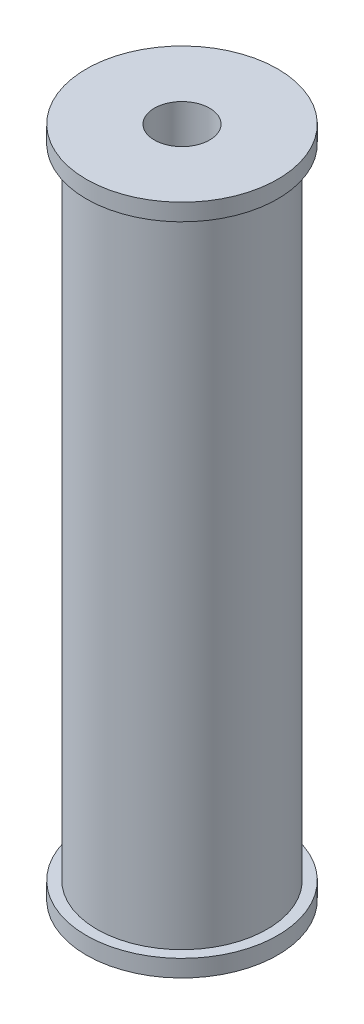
ISO-10303-21;
HEADER;
FILE_DESCRIPTION(('STEP AP214'),'2;1');
FILE_NAME('part.step','',(''),(''),'','','');
FILE_SCHEMA(('AUTOMOTIVE_DESIGN { 1 0 10303 214 1 1 1 1 }'));
ENDSEC;
DATA;
#1=APPLICATION_CONTEXT('core data for automotive mechanical design processes');
#2=APPLICATION_PROTOCOL_DEFINITION('international standard','automotive_design',2000,#1);
#3=PRODUCT_CONTEXT('',#1,'mechanical');
#4=PRODUCT('Part','Part','',(#3));
#5=PRODUCT_RELATED_PRODUCT_CATEGORY('part','',(#4));
#6=PRODUCT_DEFINITION_FORMATION('','',#4);
#7=PRODUCT_DEFINITION_CONTEXT('part definition',#1,'design');
#8=PRODUCT_DEFINITION('design','',#6,#7);
#9=PRODUCT_DEFINITION_SHAPE('','',#8);
#10=(LENGTH_UNIT() NAMED_UNIT(*) SI_UNIT(.MILLI.,.METRE.));
#11=(NAMED_UNIT(*) PLANE_ANGLE_UNIT() SI_UNIT($,.RADIAN.));
#12=(NAMED_UNIT(*) SI_UNIT($,.STERADIAN.) SOLID_ANGLE_UNIT());
#13=UNCERTAINTY_MEASURE_WITH_UNIT(LENGTH_MEASURE(1.E-05),#10,'distance_accuracy_value','');
#14=(GEOMETRIC_REPRESENTATION_CONTEXT(3) GLOBAL_UNCERTAINTY_ASSIGNED_CONTEXT((#13)) GLOBAL_UNIT_ASSIGNED_CONTEXT((#10,
#11,#12)) REPRESENTATION_CONTEXT('',''));
#15=CARTESIAN_POINT('',(0.,0.,0.));
#16=DIRECTION('',(0.,0.,1.));
#17=DIRECTION('',(1.,0.,0.));
#18=AXIS2_PLACEMENT_3D('',#15,#16,#17);
#19=CARTESIAN_POINT('',(0.,2.54,0.));
#20=DIRECTION('',(0.,1.,0.));
#21=DIRECTION('',(0.,0.,1.));
#22=AXIS2_PLACEMENT_3D('',#19,#20,#21);
#23=PLANE('',#22);
#24=CARTESIAN_POINT('',(0.,2.54,0.));
#25=DIRECTION('',(0.,1.,0.));
#26=DIRECTION('',(0.,0.,1.));
#27=AXIS2_PLACEMENT_3D('',#24,#25,#26);
#28=CIRCLE('',#27,14.2875);
#29=CARTESIAN_POINT('',(0.,2.54,14.2875));
#30=VERTEX_POINT('',#29);
#31=EDGE_CURVE('E10',#30,#30,#28,.T.);
#32=ORIENTED_EDGE('',*,*,#31,.T.);
#33=EDGE_LOOP('',(#32));
#34=FACE_BOUND('',#33,.T.);
#35=CARTESIAN_POINT('',(0.,2.54,0.));
#36=DIRECTION('',(0.,1.,0.));
#37=DIRECTION('',(0.,0.,1.));
#38=AXIS2_PLACEMENT_3D('',#35,#36,#37);
#39=CIRCLE('',#38,12.7);
#40=CARTESIAN_POINT('',(0.,2.54,12.7));
#41=VERTEX_POINT('',#40);
#42=EDGE_CURVE('E43',#41,#41,#39,.T.);
#43=ORIENTED_EDGE('',*,*,#42,.F.);
#44=EDGE_LOOP('',(#43));
#45=FACE_BOUND('',#44,.T.);
#46=ADVANCED_FACE('F28',(#34,#45),#23,.T.);
#47=CARTESIAN_POINT('',(0.,2.54,0.));
#48=DIRECTION('',(0.,-1.,0.));
#49=DIRECTION('',(0.,0.,-1.));
#50=AXIS2_PLACEMENT_3D('',#47,#48,#49);
#51=CYLINDRICAL_SURFACE('',#50,14.2875);
#52=ORIENTED_EDGE('',*,*,#31,.F.);
#53=EDGE_LOOP('',(#52));
#54=FACE_BOUND('',#53,.T.);
#55=CARTESIAN_POINT('',(0.,0.,0.));
#56=DIRECTION('',(0.,1.,0.));
#57=DIRECTION('',(0.,0.,1.));
#58=AXIS2_PLACEMENT_3D('',#55,#56,#57);
#59=CIRCLE('',#58,14.2875);
#60=CARTESIAN_POINT('',(0.,0.,14.2875));
#61=VERTEX_POINT('',#60);
#62=EDGE_CURVE('E35',#61,#61,#59,.T.);
#63=ORIENTED_EDGE('',*,*,#62,.T.);
#64=EDGE_LOOP('',(#63));
#65=FACE_BOUND('',#64,.T.);
#66=ADVANCED_FACE('F30',(#54,#65),#51,.T.);
#67=CARTESIAN_POINT('',(0.,0.,0.));
#68=DIRECTION('',(0.,1.,0.));
#69=DIRECTION('',(0.,0.,1.));
#70=AXIS2_PLACEMENT_3D('',#67,#68,#69);
#71=PLANE('',#70);
#72=CARTESIAN_POINT('',(0.,0.,0.));
#73=DIRECTION('',(0.,1.,0.));
#74=DIRECTION('',(0.,0.,1.));
#75=AXIS2_PLACEMENT_3D('',#72,#73,#74);
#76=CIRCLE('',#75,4.1275);
#77=CARTESIAN_POINT('',(0.,0.,4.1275));
#78=VERTEX_POINT('',#77);
#79=EDGE_CURVE('E54',#78,#78,#76,.T.);
#80=ORIENTED_EDGE('',*,*,#79,.T.);
#81=EDGE_LOOP('',(#80));
#82=FACE_BOUND('',#81,.T.);
#83=ORIENTED_EDGE('',*,*,#62,.F.);
#84=EDGE_LOOP('',(#83));
#85=FACE_BOUND('',#84,.T.);
#86=ADVANCED_FACE('F84',(#82,#85),#71,.F.);
#87=CARTESIAN_POINT('',(0.,97.79,0.));
#88=DIRECTION('',(0.,-1.,0.));
#89=DIRECTION('',(0.,0.,-1.));
#90=AXIS2_PLACEMENT_3D('',#87,#88,#89);
#91=CYLINDRICAL_SURFACE('',#90,12.7);
#92=CARTESIAN_POINT('',(0.,97.79,0.));
#93=DIRECTION('',(0.,1.,0.));
#94=DIRECTION('',(0.,0.,1.));
#95=AXIS2_PLACEMENT_3D('',#92,#93,#94);
#96=CIRCLE('',#95,12.7);
#97=CARTESIAN_POINT('',(0.,97.79,12.7));
#98=VERTEX_POINT('',#97);
#99=EDGE_CURVE('E39',#98,#98,#96,.T.);
#100=ORIENTED_EDGE('',*,*,#99,.F.);
#101=EDGE_LOOP('',(#100));
#102=FACE_BOUND('',#101,.T.);
#103=ORIENTED_EDGE('',*,*,#42,.T.);
#104=EDGE_LOOP('',(#103));
#105=FACE_BOUND('',#104,.T.);
#106=ADVANCED_FACE('F78',(#102,#105),#91,.T.);
#107=CARTESIAN_POINT('',(0.,97.79,0.));
#108=DIRECTION('',(0.,1.,0.));
#109=DIRECTION('',(0.,0.,1.));
#110=AXIS2_PLACEMENT_3D('',#107,#108,#109);
#111=PLANE('',#110);
#112=CARTESIAN_POINT('',(0.,97.79,0.));
#113=DIRECTION('',(0.,1.,0.));
#114=DIRECTION('',(0.,0.,1.));
#115=AXIS2_PLACEMENT_3D('',#112,#113,#114);
#116=CIRCLE('',#115,14.2875);
#117=CARTESIAN_POINT('',(0.,97.79,14.2875));
#118=VERTEX_POINT('',#117);
#119=EDGE_CURVE('E51',#118,#118,#116,.T.);
#120=ORIENTED_EDGE('',*,*,#119,.F.);
#121=EDGE_LOOP('',(#120));
#122=FACE_BOUND('',#121,.T.);
#123=ORIENTED_EDGE('',*,*,#99,.T.);
#124=EDGE_LOOP('',(#123));
#125=FACE_BOUND('',#124,.T.);
#126=ADVANCED_FACE('F72',(#122,#125),#111,.F.);
#127=CARTESIAN_POINT('',(0.,100.33,0.));
#128=DIRECTION('',(0.,-1.,0.));
#129=DIRECTION('',(0.,0.,-1.));
#130=AXIS2_PLACEMENT_3D('',#127,#128,#129);
#131=CYLINDRICAL_SURFACE('',#130,14.2875);
#132=CARTESIAN_POINT('',(0.,100.33,0.));
#133=DIRECTION('',(0.,1.,0.));
#134=DIRECTION('',(0.,0.,1.));
#135=AXIS2_PLACEMENT_3D('',#132,#133,#134);
#136=CIRCLE('',#135,14.2875);
#137=CARTESIAN_POINT('',(0.,100.33,14.2875));
#138=VERTEX_POINT('',#137);
#139=EDGE_CURVE('E48',#138,#138,#136,.T.);
#140=ORIENTED_EDGE('',*,*,#139,.F.);
#141=EDGE_LOOP('',(#140));
#142=FACE_BOUND('',#141,.T.);
#143=ORIENTED_EDGE('',*,*,#119,.T.);
#144=EDGE_LOOP('',(#143));
#145=FACE_BOUND('',#144,.T.);
#146=ADVANCED_FACE('F66',(#142,#145),#131,.T.);
#147=CARTESIAN_POINT('',(0.,100.33,0.));
#148=DIRECTION('',(0.,1.,0.));
#149=DIRECTION('',(0.,0.,1.));
#150=AXIS2_PLACEMENT_3D('',#147,#148,#149);
#151=PLANE('',#150);
#152=CARTESIAN_POINT('',(0.,100.33,0.));
#153=DIRECTION('',(0.,1.,0.));
#154=DIRECTION('',(0.,0.,1.));
#155=AXIS2_PLACEMENT_3D('',#152,#153,#154);
#156=CIRCLE('',#155,4.1275);
#157=CARTESIAN_POINT('',(0.,100.33,4.1275));
#158=VERTEX_POINT('',#157);
#159=EDGE_CURVE('E57',#158,#158,#156,.T.);
#160=ORIENTED_EDGE('',*,*,#159,.F.);
#161=EDGE_LOOP('',(#160));
#162=FACE_BOUND('',#161,.T.);
#163=ORIENTED_EDGE('',*,*,#139,.T.);
#164=EDGE_LOOP('',(#163));
#165=FACE_BOUND('',#164,.T.);
#166=ADVANCED_FACE('F63',(#162,#165),#151,.T.);
#167=CARTESIAN_POINT('',(0.,0.,0.));
#168=DIRECTION('',(0.,1.,0.));
#169=DIRECTION('',(0.,0.,1.));
#170=AXIS2_PLACEMENT_3D('',#167,#168,#169);
#171=CYLINDRICAL_SURFACE('',#170,4.1275);
#172=ORIENTED_EDGE('',*,*,#79,.F.);
#173=EDGE_LOOP('',(#172));
#174=FACE_BOUND('',#173,.T.);
#175=ORIENTED_EDGE('',*,*,#159,.T.);
#176=EDGE_LOOP('',(#175));
#177=FACE_BOUND('',#176,.T.);
#178=ADVANCED_FACE('F61',(#174,#177),#171,.F.);
#179=CLOSED_SHELL('',(#46,#66,#86,#106,#126,#146,#166,#178));
#180=MANIFOLD_SOLID_BREP('B2',#179);
#181=ADVANCED_BREP_SHAPE_REPRESENTATION('',(#18,#180),#14);
#182=SHAPE_DEFINITION_REPRESENTATION(#9,#181);
ENDSEC;
END-ISO-10303-21;
